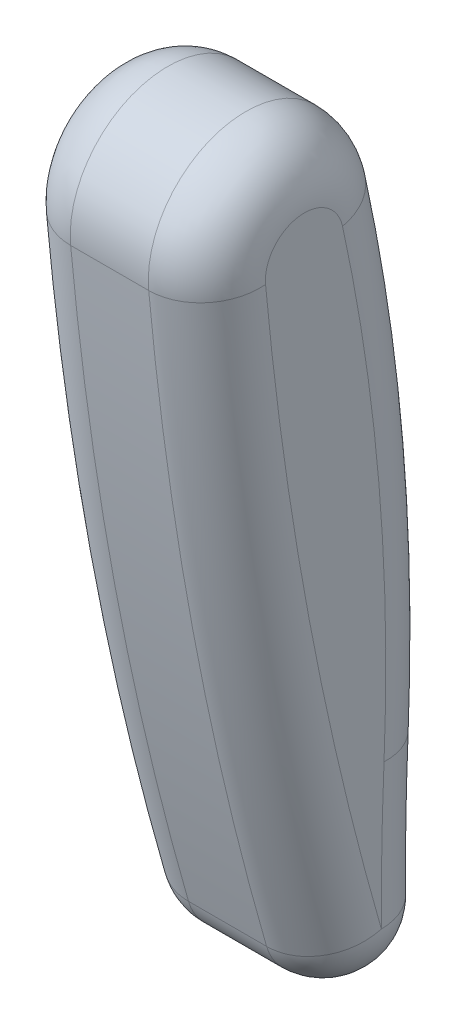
ISO-10303-21;
HEADER;
FILE_DESCRIPTION(('STEP AP214'),'2;1');
FILE_NAME('part.step','',(''),(''),'','','');
FILE_SCHEMA(('AUTOMOTIVE_DESIGN { 1 0 10303 214 1 1 1 1 }'));
ENDSEC;
DATA;
#1=APPLICATION_CONTEXT('core data for automotive mechanical design processes');
#2=APPLICATION_PROTOCOL_DEFINITION('international standard','automotive_design',2000,#1);
#3=PRODUCT_CONTEXT('',#1,'mechanical');
#4=PRODUCT('Part','Part','',(#3));
#5=PRODUCT_RELATED_PRODUCT_CATEGORY('part','',(#4));
#6=PRODUCT_DEFINITION_FORMATION('','',#4);
#7=PRODUCT_DEFINITION_CONTEXT('part definition',#1,'design');
#8=PRODUCT_DEFINITION('design','',#6,#7);
#9=PRODUCT_DEFINITION_SHAPE('','',#8);
#10=(LENGTH_UNIT() NAMED_UNIT(*) SI_UNIT(.MILLI.,.METRE.));
#11=(NAMED_UNIT(*) PLANE_ANGLE_UNIT() SI_UNIT($,.RADIAN.));
#12=(NAMED_UNIT(*) SI_UNIT($,.STERADIAN.) SOLID_ANGLE_UNIT());
#13=UNCERTAINTY_MEASURE_WITH_UNIT(LENGTH_MEASURE(1.E-05),#10,'distance_accuracy_value','');
#14=(GEOMETRIC_REPRESENTATION_CONTEXT(3) GLOBAL_UNCERTAINTY_ASSIGNED_CONTEXT((#13)) GLOBAL_UNIT_ASSIGNED_CONTEXT((#10,
#11,#12)) REPRESENTATION_CONTEXT('',''));
#15=CARTESIAN_POINT('',(0.,0.,0.));
#16=DIRECTION('',(0.,0.,1.));
#17=DIRECTION('',(1.,0.,0.));
#18=AXIS2_PLACEMENT_3D('',#15,#16,#17);
#19=CARTESIAN_POINT('',(177.8,-559.10903574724,-2113.11328138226));
#20=DIRECTION('',(-1.,0.,0.));
#21=DIRECTION('',(0.,0.,1.));
#22=AXIS2_PLACEMENT_3D('',#19,#20,#21);
#23=CYLINDRICAL_SURFACE('',#22,2209.8);
#24=DIRECTION('',(-1.,0.,0.));
#25=VECTOR('',#24,1.);
#26=CARTESIAN_POINT('',(177.8,-761.528986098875,87.3962513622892));
#27=LINE('',#26,#25);
#28=CARTESIAN_POINT('',(139.7,-761.528986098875,87.3962513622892));
#29=VERTEX_POINT('',#28);
#30=CARTESIAN_POINT('',(88.9,-761.528986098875,87.3962513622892));
#31=VERTEX_POINT('',#30);
#32=EDGE_CURVE('E180',#29,#31,#27,.T.);
#33=ORIENTED_EDGE('',*,*,#32,.T.);
#34=CARTESIAN_POINT('',(88.9,-559.10903574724,-2113.11328138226));
#35=DIRECTION('',(-1.,0.,0.));
#36=DIRECTION('',(0.,0.,1.));
#37=AXIS2_PLACEMENT_3D('',#34,#35,#36);
#38=CIRCLE('',#37,2209.8);
#39=CARTESIAN_POINT('',(88.9,-1169.53967872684,10.7017929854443));
#40=VERTEX_POINT('',#39);
#41=EDGE_CURVE('E161',#31,#40,#38,.F.);
#42=ORIENTED_EDGE('',*,*,#41,.T.);
#43=DIRECTION('',(-1.,0.,0.));
#44=VECTOR('',#43,1.);
#45=CARTESIAN_POINT('',(177.8,-1169.53967872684,10.7017929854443));
#46=LINE('',#45,#44);
#47=CARTESIAN_POINT('',(139.7,-1169.53967872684,10.7017929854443));
#48=VERTEX_POINT('',#47);
#49=EDGE_CURVE('E125',#48,#40,#46,.T.);
#50=ORIENTED_EDGE('',*,*,#49,.F.);
#51=CARTESIAN_POINT('',(139.7,-559.10903574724,-2113.11328138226));
#52=DIRECTION('',(-1.,0.,0.));
#53=DIRECTION('',(0.,0.,1.));
#54=AXIS2_PLACEMENT_3D('',#51,#52,#53);
#55=CIRCLE('',#54,2209.8);
#56=EDGE_CURVE('E159',#48,#29,#55,.T.);
#57=ORIENTED_EDGE('',*,*,#56,.T.);
#58=EDGE_LOOP('',(#33,#42,#50,#57));
#59=FACE_BOUND('',#58,.T.);
#60=ADVANCED_FACE('F33',(#59),#23,.T.);
#61=CARTESIAN_POINT('',(177.8,-1159.01501246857,-25.9157082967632));
#62=DIRECTION('',(-1.,0.,0.));
#63=DIRECTION('',(0.,0.,1.));
#64=AXIS2_PLACEMENT_3D('',#61,#62,#63);
#65=CYLINDRICAL_SURFACE('',#64,38.100000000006);
#66=ORIENTED_EDGE('',*,*,#49,.T.);
#67=CARTESIAN_POINT('',(88.9,-1159.01501246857,-25.9157082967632));
#68=DIRECTION('',(-1.,0.,0.));
#69=DIRECTION('',(0.,0.,1.));
#70=AXIS2_PLACEMENT_3D('',#67,#68,#69);
#71=CIRCLE('',#70,38.100000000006);
#72=CARTESIAN_POINT('',(88.9,-1158.77775860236,-64.01496958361));
#73=VERTEX_POINT('',#72);
#74=EDGE_CURVE('E115',#40,#73,#71,.F.);
#75=ORIENTED_EDGE('',*,*,#74,.T.);
#76=DIRECTION('',(-1.,0.,0.));
#77=VECTOR('',#76,1.);
#78=CARTESIAN_POINT('',(177.8,-1158.77775860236,-64.01496958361));
#79=LINE('',#78,#77);
#80=CARTESIAN_POINT('',(139.7,-1158.77775860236,-64.01496958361));
#81=VERTEX_POINT('',#80);
#82=EDGE_CURVE('E108',#81,#73,#79,.T.);
#83=ORIENTED_EDGE('',*,*,#82,.F.);
#84=CARTESIAN_POINT('',(139.7,-1159.01501246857,-25.9157082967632));
#85=DIRECTION('',(-1.,0.,0.));
#86=DIRECTION('',(0.,0.,1.));
#87=AXIS2_PLACEMENT_3D('',#84,#85,#86);
#88=CIRCLE('',#87,38.100000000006);
#89=EDGE_CURVE('E122',#81,#48,#88,.T.);
#90=ORIENTED_EDGE('',*,*,#89,.T.);
#91=EDGE_LOOP('',(#66,#75,#83,#90));
#92=FACE_BOUND('',#91,.T.);
#93=ADVANCED_FACE('F120',(#92),#65,.T.);
#94=CARTESIAN_POINT('',(177.8,-1147.29470222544,-1908.01427826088));
#95=DIRECTION('',(-1.,0.,0.));
#96=DIRECTION('',(0.,0.,1.));
#97=AXIS2_PLACEMENT_3D('',#94,#95,#96);
#98=CYLINDRICAL_SURFACE('',#97,1844.03506229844);
#99=ORIENTED_EDGE('',*,*,#82,.T.);
#100=CARTESIAN_POINT('',(88.9,-1147.29470222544,-1908.01427826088));
#101=DIRECTION('',(-1.,0.,0.));
#102=DIRECTION('',(0.,0.,1.));
#103=AXIS2_PLACEMENT_3D('',#100,#101,#102);
#104=CIRCLE('',#103,1844.03506229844);
#105=CARTESIAN_POINT('',(88.9,-1067.28642691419,-65.715717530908));
#106=VERTEX_POINT('',#105);
#107=EDGE_CURVE('E114',#73,#106,#104,.T.);
#108=ORIENTED_EDGE('',*,*,#107,.T.);
#109=DIRECTION('',(-1.,0.,0.));
#110=VECTOR('',#109,1.);
#111=CARTESIAN_POINT('',(177.8,-1067.28642691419,-65.715717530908));
#112=LINE('',#111,#110);
#113=CARTESIAN_POINT('',(139.7,-1067.28642691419,-65.715717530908));
#114=VERTEX_POINT('',#113);
#115=EDGE_CURVE('E110',#114,#106,#112,.T.);
#116=ORIENTED_EDGE('',*,*,#115,.F.);
#117=CARTESIAN_POINT('',(139.7,-1147.29470222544,-1908.01427826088));
#118=DIRECTION('',(-1.,0.,0.));
#119=DIRECTION('',(0.,0.,1.));
#120=AXIS2_PLACEMENT_3D('',#117,#118,#119);
#121=CIRCLE('',#120,1844.03506229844);
#122=EDGE_CURVE('E105',#114,#81,#121,.F.);
#123=ORIENTED_EDGE('',*,*,#122,.T.);
#124=EDGE_LOOP('',(#99,#108,#116,#123));
#125=FACE_BOUND('',#124,.T.);
#126=ADVANCED_FACE('F107',(#125),#98,.F.);
#127=CARTESIAN_POINT('',(177.8,-1012.18416138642,1203.08834154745));
#128=DIRECTION('',(-1.,0.,0.));
#129=DIRECTION('',(0.,0.,1.));
#130=AXIS2_PLACEMENT_3D('',#127,#128,#129);
#131=CYLINDRICAL_SURFACE('',#130,1270.);
#132=ORIENTED_EDGE('',*,*,#115,.T.);
#133=CARTESIAN_POINT('',(88.9,-1012.18416138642,1203.08834154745));
#134=DIRECTION('',(-1.,0.,0.));
#135=DIRECTION('',(0.,0.,1.));
#136=AXIS2_PLACEMENT_3D('',#133,#134,#135);
#137=CIRCLE('',#136,1270.);
#138=CARTESIAN_POINT('',(88.9,-742.213802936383,-37.8854718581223));
#139=VERTEX_POINT('',#138);
#140=EDGE_CURVE('E152',#106,#139,#137,.F.);
#141=ORIENTED_EDGE('',*,*,#140,.T.);
#142=DIRECTION('',(-1.,0.,0.));
#143=VECTOR('',#142,1.);
#144=CARTESIAN_POINT('',(177.8,-742.213802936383,-37.8854718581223));
#145=LINE('',#144,#143);
#146=CARTESIAN_POINT('',(139.7,-742.213802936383,-37.8854718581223));
#147=VERTEX_POINT('',#146);
#148=EDGE_CURVE('E206',#147,#139,#145,.T.);
#149=ORIENTED_EDGE('',*,*,#148,.F.);
#150=CARTESIAN_POINT('',(139.7,-1012.18416138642,1203.08834154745));
#151=DIRECTION('',(-1.,0.,0.));
#152=DIRECTION('',(0.,0.,1.));
#153=AXIS2_PLACEMENT_3D('',#150,#151,#152);
#154=CIRCLE('',#153,1270.);
#155=EDGE_CURVE('E150',#147,#114,#154,.T.);
#156=ORIENTED_EDGE('',*,*,#155,.T.);
#157=EDGE_LOOP('',(#132,#141,#149,#156));
#158=FACE_BOUND('',#157,.T.);
#159=ADVANCED_FACE('F212',(#158),#131,.T.);
#160=CARTESIAN_POINT('',(177.8,-755.712320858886,24.1632188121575));
#161=DIRECTION('',(-1.,0.,0.));
#162=DIRECTION('',(0.,0.,1.));
#163=AXIS2_PLACEMENT_3D('',#160,#161,#162);
#164=CYLINDRICAL_SURFACE('',#163,63.5000000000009);
#165=ORIENTED_EDGE('',*,*,#148,.T.);
#166=CARTESIAN_POINT('',(88.9,-755.712320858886,24.1632188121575));
#167=DIRECTION('',(-1.,0.,0.));
#168=DIRECTION('',(0.,0.,1.));
#169=AXIS2_PLACEMENT_3D('',#166,#167,#168);
#170=CIRCLE('',#169,63.5000000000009);
#171=EDGE_CURVE('E157',#139,#31,#170,.F.);
#172=ORIENTED_EDGE('',*,*,#171,.T.);
#173=ORIENTED_EDGE('',*,*,#32,.F.);
#174=CARTESIAN_POINT('',(139.7,-755.712320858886,24.1632188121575));
#175=DIRECTION('',(-1.,0.,0.));
#176=DIRECTION('',(0.,0.,1.));
#177=AXIS2_PLACEMENT_3D('',#174,#175,#176);
#178=CIRCLE('',#177,63.5000000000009);
#179=EDGE_CURVE('E154',#29,#147,#178,.T.);
#180=ORIENTED_EDGE('',*,*,#179,.T.);
#181=EDGE_LOOP('',(#165,#172,#173,#180));
#182=FACE_BOUND('',#181,.T.);
#183=ADVANCED_FACE('F203',(#182),#164,.T.);
#184=CARTESIAN_POINT('',(177.8,-657.410678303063,-1044.47503128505));
#185=DIRECTION('',(-1.,0.,0.));
#186=DIRECTION('',(0.,0.,1.));
#187=AXIS2_PLACEMENT_3D('',#184,#185,#186);
#188=PLANE('',#187);
#189=CARTESIAN_POINT('',(177.8,-1012.18416138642,1203.08834154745));
#190=DIRECTION('',(-1.,0.,0.));
#191=DIRECTION('',(0.,0.,1.));
#192=AXIS2_PLACEMENT_3D('',#189,#190,#191);
#193=CIRCLE('',#192,1231.9);
#194=CARTESIAN_POINT('',(177.8,-1065.63335894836,-27.6515957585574));
#195=VERTEX_POINT('',#194);
#196=CARTESIAN_POINT('',(177.8,-750.312913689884,-0.656257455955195));
#197=VERTEX_POINT('',#196);
#198=EDGE_CURVE('E42',#195,#197,#193,.F.);
#199=ORIENTED_EDGE('',*,*,#198,.T.);
#200=CARTESIAN_POINT('',(177.8,-755.712320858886,24.1632188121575));
#201=DIRECTION('',(-1.,0.,0.));
#202=DIRECTION('',(0.,0.,1.));
#203=AXIS2_PLACEMENT_3D('',#200,#201,#202);
#204=CIRCLE('',#203,25.4000000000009);
#205=CARTESIAN_POINT('',(177.8,-758.038986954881,49.4564318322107));
#206=VERTEX_POINT('',#205);
#207=EDGE_CURVE('E11',#197,#206,#204,.F.);
#208=ORIENTED_EDGE('',*,*,#207,.T.);
#209=CARTESIAN_POINT('',(177.8,-559.10903574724,-2113.11328138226));
#210=DIRECTION('',(-1.,0.,0.));
#211=DIRECTION('',(0.,0.,1.));
#212=AXIS2_PLACEMENT_3D('',#209,#210,#211);
#213=CIRCLE('',#212,2171.7);
#214=CARTESIAN_POINT('',(177.8,-1159.01501246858,-25.9157082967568));
#215=VERTEX_POINT('',#214);
#216=EDGE_CURVE('E163',#206,#215,#213,.F.);
#217=ORIENTED_EDGE('',*,*,#216,.T.);
#218=CARTESIAN_POINT('',(177.8,-1147.29470222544,-1908.01427826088));
#219=DIRECTION('',(-1.,0.,0.));
#220=DIRECTION('',(0.,0.,1.));
#221=AXIS2_PLACEMENT_3D('',#218,#219,#220);
#222=CIRCLE('',#221,1882.13506229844);
#223=EDGE_CURVE('E53',#215,#195,#222,.T.);
#224=ORIENTED_EDGE('',*,*,#223,.T.);
#225=EDGE_LOOP('',(#199,#208,#217,#224));
#226=FACE_BOUND('',#225,.T.);
#227=ADVANCED_FACE('F194',(#226),#188,.F.);
#228=CARTESIAN_POINT('',(50.8,-657.410678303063,-1044.47503128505));
#229=DIRECTION('',(-1.,0.,0.));
#230=DIRECTION('',(0.,0.,1.));
#231=AXIS2_PLACEMENT_3D('',#228,#229,#230);
#232=PLANE('',#231);
#233=CARTESIAN_POINT('',(50.8,-1012.18416138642,1203.08834154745));
#234=DIRECTION('',(-1.,0.,0.));
#235=DIRECTION('',(0.,0.,1.));
#236=AXIS2_PLACEMENT_3D('',#233,#234,#235);
#237=CIRCLE('',#236,1231.9);
#238=CARTESIAN_POINT('',(50.8,-750.312913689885,-0.656257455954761));
#239=VERTEX_POINT('',#238);
#240=CARTESIAN_POINT('',(50.8,-1065.63335894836,-27.6515957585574));
#241=VERTEX_POINT('',#240);
#242=EDGE_CURVE('E145',#239,#241,#237,.T.);
#243=ORIENTED_EDGE('',*,*,#242,.T.);
#244=CARTESIAN_POINT('',(50.8,-1147.29470222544,-1908.01427826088));
#245=DIRECTION('',(-1.,0.,0.));
#246=DIRECTION('',(0.,0.,1.));
#247=AXIS2_PLACEMENT_3D('',#244,#245,#246);
#248=CIRCLE('',#247,1882.13506229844);
#249=CARTESIAN_POINT('',(50.8,-1159.01501246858,-25.9157082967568));
#250=VERTEX_POINT('',#249);
#251=EDGE_CURVE('E147',#241,#250,#248,.F.);
#252=ORIENTED_EDGE('',*,*,#251,.T.);
#253=CARTESIAN_POINT('',(50.8,-559.10903574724,-2113.11328138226));
#254=DIRECTION('',(-1.,0.,0.));
#255=DIRECTION('',(0.,0.,1.));
#256=AXIS2_PLACEMENT_3D('',#253,#254,#255);
#257=CIRCLE('',#256,2171.7);
#258=CARTESIAN_POINT('',(50.8,-758.038986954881,49.4564318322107));
#259=VERTEX_POINT('',#258);
#260=EDGE_CURVE('E141',#250,#259,#257,.T.);
#261=ORIENTED_EDGE('',*,*,#260,.T.);
#262=CARTESIAN_POINT('',(50.8,-755.712320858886,24.1632188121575));
#263=DIRECTION('',(-1.,0.,0.));
#264=DIRECTION('',(0.,0.,1.));
#265=AXIS2_PLACEMENT_3D('',#262,#263,#264);
#266=CIRCLE('',#265,25.4000000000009);
#267=EDGE_CURVE('E143',#259,#239,#266,.T.);
#268=ORIENTED_EDGE('',*,*,#267,.T.);
#269=EDGE_LOOP('',(#243,#252,#261,#268));
#270=FACE_BOUND('',#269,.T.);
#271=ADVANCED_FACE('F223',(#270),#232,.T.);
#272=CARTESIAN_POINT('',(88.9,-755.712320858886,24.1632188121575));
#273=DIRECTION('',(-1.,0.,0.));
#274=DIRECTION('',(0.,0.,1.));
#275=AXIS2_PLACEMENT_3D('',#272,#273,#274);
#276=DEGENERATE_TOROIDAL_SURFACE('',#275,25.4000000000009,38.1,.T.);
#277=CARTESIAN_POINT('',(88.9,-758.038986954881,49.4564318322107));
#278=DIRECTION('',(0.,-0.995795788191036,-0.0916010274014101));
#279=DIRECTION('',(0.,0.0916010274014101,-0.995795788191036));
#280=AXIS2_PLACEMENT_3D('',#277,#278,#279);
#281=CIRCLE('',#280,38.1);
#282=EDGE_CURVE('E174',#31,#259,#281,.T.);
#283=ORIENTED_EDGE('',*,*,#282,.F.);
#284=ORIENTED_EDGE('',*,*,#171,.F.);
#285=CARTESIAN_POINT('',(88.9,-750.312913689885,-0.656257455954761));
#286=DIRECTION('',(0.,-0.977144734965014,-0.21257508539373));
#287=DIRECTION('',(0.,0.21257508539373,-0.977144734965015));
#288=AXIS2_PLACEMENT_3D('',#285,#286,#287);
#289=CIRCLE('',#288,38.1);
#290=EDGE_CURVE('E177',#239,#139,#289,.T.);
#291=ORIENTED_EDGE('',*,*,#290,.F.);
#292=ORIENTED_EDGE('',*,*,#267,.F.);
#293=EDGE_LOOP('',(#283,#284,#291,#292));
#294=FACE_BOUND('',#293,.T.);
#295=ADVANCED_FACE('F227',(#294),#276,.T.);
#296=CARTESIAN_POINT('',(88.9,-1012.18416138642,1203.08834154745));
#297=DIRECTION('',(-1.,0.,0.));
#298=DIRECTION('',(0.,0.,1.));
#299=AXIS2_PLACEMENT_3D('',#296,#297,#298);
#300=TOROIDAL_SURFACE('',#299,1231.9,38.1);
#301=ORIENTED_EDGE('',*,*,#290,.T.);
#302=ORIENTED_EDGE('',*,*,#140,.F.);
#303=CARTESIAN_POINT('',(88.9,-1065.63335894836,-27.6515957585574));
#304=DIRECTION('',(0.,-0.999058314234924,0.0433876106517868));
#305=DIRECTION('',(0.,-0.0433876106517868,-0.999058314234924));
#306=AXIS2_PLACEMENT_3D('',#303,#304,#305);
#307=CIRCLE('',#306,38.1);
#308=EDGE_CURVE('E171',#241,#106,#307,.T.);
#309=ORIENTED_EDGE('',*,*,#308,.F.);
#310=ORIENTED_EDGE('',*,*,#242,.F.);
#311=EDGE_LOOP('',(#301,#302,#309,#310));
#312=FACE_BOUND('',#311,.T.);
#313=ADVANCED_FACE('F215',(#312),#300,.T.);
#314=CARTESIAN_POINT('',(88.9,-559.10903574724,-2113.11328138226));
#315=DIRECTION('',(-1.,0.,0.));
#316=DIRECTION('',(0.,0.,1.));
#317=AXIS2_PLACEMENT_3D('',#314,#315,#316);
#318=TOROIDAL_SURFACE('',#317,2171.7,38.1);
#319=ORIENTED_EDGE('',*,*,#282,.T.);
#320=ORIENTED_EDGE('',*,*,#260,.F.);
#321=CARTESIAN_POINT('',(88.9,-1159.01501246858,-25.9157082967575));
#322=DIRECTION('',(0.,-0.961089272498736,-0.276237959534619));
#323=DIRECTION('',(0.,0.276237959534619,-0.961089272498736));
#324=AXIS2_PLACEMENT_3D('',#321,#322,#323);
#325=CIRCLE('',#324,38.1);
#326=EDGE_CURVE('E168',#40,#250,#325,.T.);
#327=ORIENTED_EDGE('',*,*,#326,.F.);
#328=ORIENTED_EDGE('',*,*,#41,.F.);
#329=EDGE_LOOP('',(#319,#320,#327,#328));
#330=FACE_BOUND('',#329,.T.);
#331=ADVANCED_FACE('F231',(#330),#318,.T.);
#332=CARTESIAN_POINT('',(88.9,-1147.29470222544,-1908.01427826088));
#333=DIRECTION('',(-1.,0.,0.));
#334=DIRECTION('',(0.,0.,1.));
#335=AXIS2_PLACEMENT_3D('',#332,#333,#334);
#336=TOROIDAL_SURFACE('',#335,1882.13506229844,38.1);
#337=ORIENTED_EDGE('',*,*,#308,.T.);
#338=ORIENTED_EDGE('',*,*,#107,.F.);
#339=CARTESIAN_POINT('',(88.9,-1159.01501246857,-25.9157082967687));
#340=DIRECTION('',(0.,-0.999980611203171,-0.00622713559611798));
#341=DIRECTION('',(0.,0.00622713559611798,-0.999980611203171));
#342=AXIS2_PLACEMENT_3D('',#339,#340,#341);
#343=CIRCLE('',#342,38.1);
#344=EDGE_CURVE('E131',#250,#73,#343,.T.);
#345=ORIENTED_EDGE('',*,*,#344,.F.);
#346=ORIENTED_EDGE('',*,*,#251,.F.);
#347=EDGE_LOOP('',(#337,#338,#345,#346));
#348=FACE_BOUND('',#347,.T.);
#349=ADVANCED_FACE('F221',(#348),#336,.T.);
#350=CARTESIAN_POINT('',(88.9,-1159.01501246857,-25.9157082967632));
#351=DIRECTION('',(0.,0.,1.));
#352=DIRECTION('',(1.,0.,0.));
#353=AXIS2_PLACEMENT_3D('',#350,#351,#352);
#354=SPHERICAL_SURFACE('',#353,38.1);
#355=ORIENTED_EDGE('',*,*,#74,.F.);
#356=ORIENTED_EDGE('',*,*,#326,.T.);
#357=ORIENTED_EDGE('',*,*,#344,.T.);
#358=EDGE_LOOP('',(#355,#356,#357));
#359=FACE_BOUND('',#358,.T.);
#360=ADVANCED_FACE('F233',(#359),#354,.T.);
#361=CARTESIAN_POINT('',(139.7,-1147.29470222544,-1908.01427826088));
#362=DIRECTION('',(-1.,0.,0.));
#363=DIRECTION('',(0.,0.,1.));
#364=AXIS2_PLACEMENT_3D('',#361,#362,#363);
#365=TOROIDAL_SURFACE('',#364,1882.13506229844,38.1);
#366=CARTESIAN_POINT('',(139.7,-1159.01501246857,-25.9157082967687));
#367=DIRECTION('',(0.,-0.999980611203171,-0.00622713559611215));
#368=DIRECTION('',(0.,0.00622713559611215,-0.999980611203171));
#369=AXIS2_PLACEMENT_3D('',#366,#367,#368);
#370=CIRCLE('',#369,38.1);
#371=EDGE_CURVE('E37',#81,#215,#370,.T.);
#372=ORIENTED_EDGE('',*,*,#371,.F.);
#373=ORIENTED_EDGE('',*,*,#122,.F.);
#374=CARTESIAN_POINT('',(139.7,-1065.63335894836,-27.6515957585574));
#375=DIRECTION('',(0.,0.999058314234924,-0.0433876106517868));
#376=DIRECTION('',(0.,0.0433876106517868,0.999058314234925));
#377=AXIS2_PLACEMENT_3D('',#374,#375,#376);
#378=CIRCLE('',#377,38.1);
#379=EDGE_CURVE('E132',#195,#114,#378,.T.);
#380=ORIENTED_EDGE('',*,*,#379,.F.);
#381=ORIENTED_EDGE('',*,*,#223,.F.);
#382=EDGE_LOOP('',(#372,#373,#380,#381));
#383=FACE_BOUND('',#382,.T.);
#384=ADVANCED_FACE('F35',(#383),#365,.T.);
#385=CARTESIAN_POINT('',(139.7,-1159.01501246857,-25.9157082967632));
#386=DIRECTION('',(0.,0.,1.));
#387=DIRECTION('',(1.,0.,0.));
#388=AXIS2_PLACEMENT_3D('',#385,#386,#387);
#389=SPHERICAL_SURFACE('',#388,38.1);
#390=ORIENTED_EDGE('',*,*,#89,.F.);
#391=ORIENTED_EDGE('',*,*,#371,.T.);
#392=CARTESIAN_POINT('',(139.7,-1159.01501246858,-25.9157082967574));
#393=DIRECTION('',(0.,0.961089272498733,0.27623795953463));
#394=DIRECTION('',(0.,-0.27623795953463,0.961089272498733));
#395=AXIS2_PLACEMENT_3D('',#392,#393,#394);
#396=CIRCLE('',#395,38.1);
#397=EDGE_CURVE('E134',#48,#215,#396,.T.);
#398=ORIENTED_EDGE('',*,*,#397,.F.);
#399=EDGE_LOOP('',(#390,#391,#398));
#400=FACE_BOUND('',#399,.T.);
#401=ADVANCED_FACE('F133',(#400),#389,.T.);
#402=CARTESIAN_POINT('',(139.7,-1012.18416138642,1203.08834154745));
#403=DIRECTION('',(-1.,0.,0.));
#404=DIRECTION('',(0.,0.,1.));
#405=AXIS2_PLACEMENT_3D('',#402,#403,#404);
#406=TOROIDAL_SURFACE('',#405,1231.9,38.1);
#407=ORIENTED_EDGE('',*,*,#379,.T.);
#408=ORIENTED_EDGE('',*,*,#155,.F.);
#409=CARTESIAN_POINT('',(139.7,-750.312913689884,-0.656257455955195));
#410=DIRECTION('',(0.,0.977144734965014,0.21257508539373));
#411=DIRECTION('',(0.,-0.21257508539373,0.977144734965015));
#412=AXIS2_PLACEMENT_3D('',#409,#410,#411);
#413=CIRCLE('',#412,38.1);
#414=EDGE_CURVE('E183',#197,#147,#413,.T.);
#415=ORIENTED_EDGE('',*,*,#414,.F.);
#416=ORIENTED_EDGE('',*,*,#198,.F.);
#417=EDGE_LOOP('',(#407,#408,#415,#416));
#418=FACE_BOUND('',#417,.T.);
#419=ADVANCED_FACE('F187',(#418),#406,.T.);
#420=CARTESIAN_POINT('',(139.7,-559.10903574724,-2113.11328138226));
#421=DIRECTION('',(-1.,0.,0.));
#422=DIRECTION('',(0.,0.,1.));
#423=AXIS2_PLACEMENT_3D('',#420,#421,#422);
#424=TOROIDAL_SURFACE('',#423,2171.7,38.1);
#425=ORIENTED_EDGE('',*,*,#397,.T.);
#426=ORIENTED_EDGE('',*,*,#216,.F.);
#427=CARTESIAN_POINT('',(139.7,-758.038986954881,49.4564318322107));
#428=DIRECTION('',(0.,0.995795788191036,0.0916010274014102));
#429=DIRECTION('',(0.,-0.0916010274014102,0.995795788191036));
#430=AXIS2_PLACEMENT_3D('',#427,#428,#429);
#431=CIRCLE('',#430,38.1);
#432=EDGE_CURVE('E181',#29,#206,#431,.T.);
#433=ORIENTED_EDGE('',*,*,#432,.F.);
#434=ORIENTED_EDGE('',*,*,#56,.F.);
#435=EDGE_LOOP('',(#425,#426,#433,#434));
#436=FACE_BOUND('',#435,.T.);
#437=ADVANCED_FACE('F196',(#436),#424,.T.);
#438=CARTESIAN_POINT('',(139.7,-755.712320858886,24.1632188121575));
#439=DIRECTION('',(-1.,0.,0.));
#440=DIRECTION('',(0.,0.,1.));
#441=AXIS2_PLACEMENT_3D('',#438,#439,#440);
#442=DEGENERATE_TOROIDAL_SURFACE('',#441,25.4000000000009,38.1,.T.);
#443=ORIENTED_EDGE('',*,*,#414,.T.);
#444=ORIENTED_EDGE('',*,*,#179,.F.);
#445=ORIENTED_EDGE('',*,*,#432,.T.);
#446=ORIENTED_EDGE('',*,*,#207,.F.);
#447=EDGE_LOOP('',(#443,#444,#445,#446));
#448=FACE_BOUND('',#447,.T.);
#449=ADVANCED_FACE('F191',(#448),#442,.T.);
#450=CLOSED_SHELL('',(#60,#93,#126,#159,#183,#227,#271,#295,#313,#331,#349,#360,#384,#401,#419,
#437,#449));
#451=MANIFOLD_SOLID_BREP('B2',#450);
#452=ADVANCED_BREP_SHAPE_REPRESENTATION('',(#18,#451),#14);
#453=SHAPE_DEFINITION_REPRESENTATION(#9,#452);
ENDSEC;
END-ISO-10303-21;
